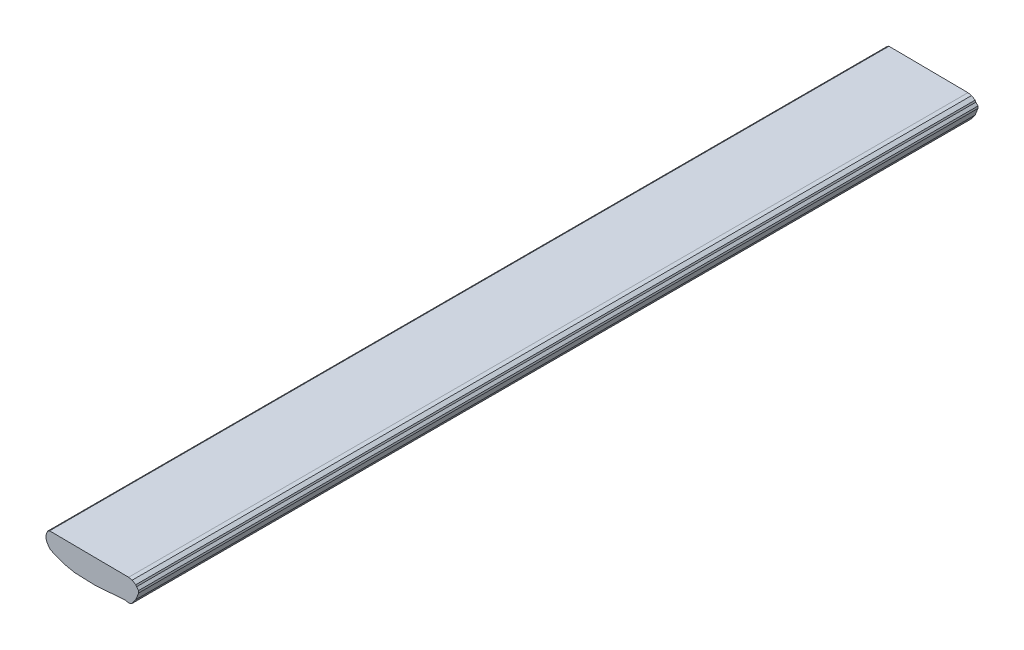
from build123d import *

# Parameters (mm, degrees)
EXTRUDE1_DEPTH = 1168.4


with BuildPart() as part:
    # Sketch1 → Extrude1 (new body)
    with BuildSketch(Plane.XY.offset(8.4)):
        Polygon((572, 148), (570, 142), (570, 138), (571, 135), (574, 130), (576, 128), (580, 126), (585, 124), (596, 120), (610, 117), (637, 116), (681, 119), (685, 118), (689, 119), (695, 127), (699, 137), (699, 140), (696, 143), (695, 145), (690, 148), (685, 149), (575, 150), align=None)
    extrude(amount=-EXTRUDE1_DEPTH)


solid = part.part
